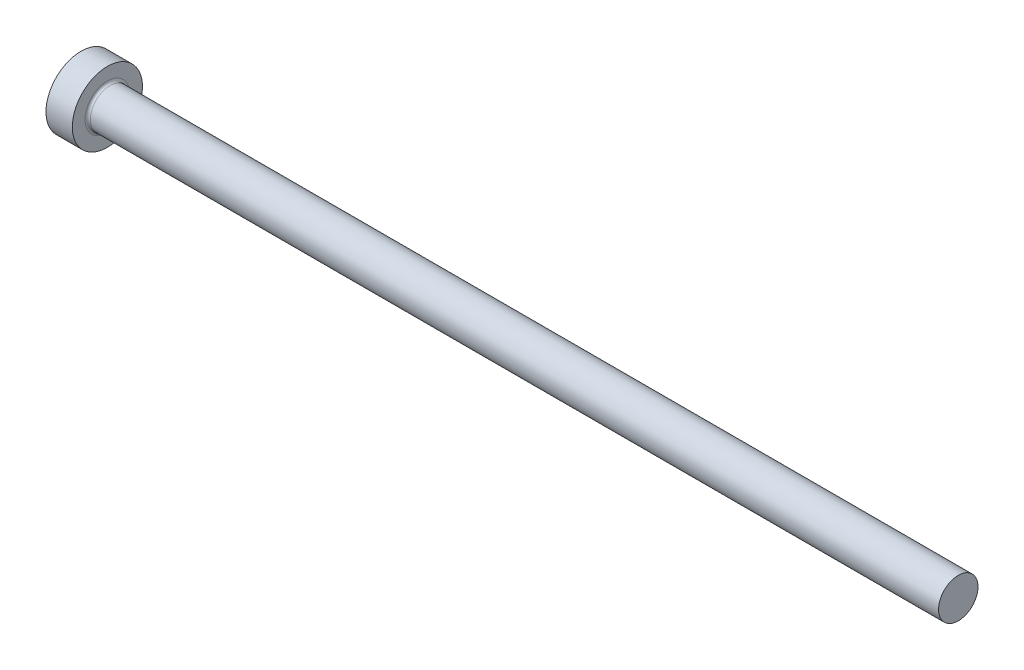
ISO-10303-21;
HEADER;
FILE_DESCRIPTION(('STEP AP214'),'2;1');
FILE_NAME('part.step','',(''),(''),'','','');
FILE_SCHEMA(('AUTOMOTIVE_DESIGN { 1 0 10303 214 1 1 1 1 }'));
ENDSEC;
DATA;
#1=APPLICATION_CONTEXT('core data for automotive mechanical design processes');
#2=APPLICATION_PROTOCOL_DEFINITION('international standard','automotive_design',2000,#1);
#3=PRODUCT_CONTEXT('',#1,'mechanical');
#4=PRODUCT('Part','Part','',(#3));
#5=PRODUCT_RELATED_PRODUCT_CATEGORY('part','',(#4));
#6=PRODUCT_DEFINITION_FORMATION('','',#4);
#7=PRODUCT_DEFINITION_CONTEXT('part definition',#1,'design');
#8=PRODUCT_DEFINITION('design','',#6,#7);
#9=PRODUCT_DEFINITION_SHAPE('','',#8);
#10=(LENGTH_UNIT() NAMED_UNIT(*) SI_UNIT(.MILLI.,.METRE.));
#11=(NAMED_UNIT(*) PLANE_ANGLE_UNIT() SI_UNIT($,.RADIAN.));
#12=(NAMED_UNIT(*) SI_UNIT($,.STERADIAN.) SOLID_ANGLE_UNIT());
#13=UNCERTAINTY_MEASURE_WITH_UNIT(LENGTH_MEASURE(1.E-05),#10,'distance_accuracy_value','');
#14=(GEOMETRIC_REPRESENTATION_CONTEXT(3) GLOBAL_UNCERTAINTY_ASSIGNED_CONTEXT((#13)) GLOBAL_UNIT_ASSIGNED_CONTEXT((#10,
#11,#12)) REPRESENTATION_CONTEXT('',''));
#15=CARTESIAN_POINT('',(0.,0.,0.));
#16=DIRECTION('',(0.,0.,1.));
#17=DIRECTION('',(1.,0.,0.));
#18=AXIS2_PLACEMENT_3D('',#15,#16,#17);
#19=CARTESIAN_POINT('',(0.,0.,0.));
#20=DIRECTION('',(-1.,0.,0.));
#21=DIRECTION('',(0.,-1.,0.));
#22=AXIS2_PLACEMENT_3D('',#19,#20,#21);
#23=PLANE('',#22);
#24=CARTESIAN_POINT('',(0.,0.,0.));
#25=DIRECTION('',(1.,0.,0.));
#26=DIRECTION('',(0.,1.,0.));
#27=AXIS2_PLACEMENT_3D('',#24,#25,#26);
#28=CIRCLE('',#27,4.);
#29=CARTESIAN_POINT('',(0.,4.,0.));
#30=VERTEX_POINT('',#29);
#31=EDGE_CURVE('E25',#30,#30,#28,.T.);
#32=ORIENTED_EDGE('',*,*,#31,.F.);
#33=EDGE_LOOP('',(#32));
#34=FACE_BOUND('',#33,.T.);
#35=ADVANCED_FACE('F14',(#34),#23,.T.);
#36=CARTESIAN_POINT('',(100.,0.,0.));
#37=DIRECTION('',(1.,0.,0.));
#38=DIRECTION('',(0.,1.,0.));
#39=AXIS2_PLACEMENT_3D('',#36,#37,#38);
#40=CYLINDRICAL_SURFACE('',#39,4.);
#41=ORIENTED_EDGE('',*,*,#31,.T.);
#42=EDGE_LOOP('',(#41));
#43=FACE_BOUND('',#42,.T.);
#44=CARTESIAN_POINT('',(3.,0.,0.));
#45=DIRECTION('',(1.,0.,0.));
#46=DIRECTION('',(0.,1.,0.));
#47=AXIS2_PLACEMENT_3D('',#44,#45,#46);
#48=CIRCLE('',#47,4.);
#49=CARTESIAN_POINT('',(3.,4.,0.));
#50=VERTEX_POINT('',#49);
#51=EDGE_CURVE('E29',#50,#50,#48,.T.);
#52=ORIENTED_EDGE('',*,*,#51,.F.);
#53=EDGE_LOOP('',(#52));
#54=FACE_BOUND('',#53,.T.);
#55=ADVANCED_FACE('F51',(#43,#54),#40,.T.);
#56=CARTESIAN_POINT('',(3.,4.,0.));
#57=DIRECTION('',(1.,0.,0.));
#58=DIRECTION('',(0.,1.,0.));
#59=AXIS2_PLACEMENT_3D('',#56,#57,#58);
#60=PLANE('',#59);
#61=CARTESIAN_POINT('',(3.,0.,0.));
#62=DIRECTION('',(1.,0.,0.));
#63=DIRECTION('',(0.,1.,0.));
#64=AXIS2_PLACEMENT_3D('',#61,#62,#63);
#65=CIRCLE('',#64,2.55);
#66=CARTESIAN_POINT('',(3.,2.55,0.));
#67=VERTEX_POINT('',#66);
#68=EDGE_CURVE('E9',#67,#67,#65,.F.);
#69=ORIENTED_EDGE('',*,*,#68,.T.);
#70=EDGE_LOOP('',(#69));
#71=FACE_BOUND('',#70,.T.);
#72=ORIENTED_EDGE('',*,*,#51,.T.);
#73=EDGE_LOOP('',(#72));
#74=FACE_BOUND('',#73,.T.);
#75=ADVANCED_FACE('F42',(#71,#74),#60,.T.);
#76=CARTESIAN_POINT('',(100.,0.,0.));
#77=DIRECTION('',(1.,0.,0.));
#78=DIRECTION('',(0.,1.,0.));
#79=AXIS2_PLACEMENT_3D('',#76,#77,#78);
#80=CYLINDRICAL_SURFACE('',#79,2.24999999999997);
#81=CARTESIAN_POINT('',(3.3,0.,0.));
#82=DIRECTION('',(1.,0.,0.));
#83=DIRECTION('',(0.,1.,0.));
#84=AXIS2_PLACEMENT_3D('',#81,#82,#83);
#85=CIRCLE('',#84,2.24999999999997);
#86=CARTESIAN_POINT('',(3.3,2.24999999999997,0.));
#87=VERTEX_POINT('',#86);
#88=EDGE_CURVE('E21',#87,#87,#85,.T.);
#89=ORIENTED_EDGE('',*,*,#88,.T.);
#90=EDGE_LOOP('',(#89));
#91=FACE_BOUND('',#90,.T.);
#92=CARTESIAN_POINT('',(100.,0.,0.));
#93=DIRECTION('',(1.,0.,0.));
#94=DIRECTION('',(0.,1.,0.));
#95=AXIS2_PLACEMENT_3D('',#92,#93,#94);
#96=CIRCLE('',#95,2.25);
#97=CARTESIAN_POINT('',(100.,2.24999999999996,0.));
#98=VERTEX_POINT('',#97);
#99=EDGE_CURVE('E34',#98,#98,#96,.T.);
#100=ORIENTED_EDGE('',*,*,#99,.F.);
#101=EDGE_LOOP('',(#100));
#102=FACE_BOUND('',#101,.T.);
#103=ADVANCED_FACE('F40',(#91,#102),#80,.T.);
#104=CARTESIAN_POINT('',(100.,2.24999999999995,0.));
#105=DIRECTION('',(1.,0.,0.));
#106=DIRECTION('',(0.,1.,0.));
#107=AXIS2_PLACEMENT_3D('',#104,#105,#106);
#108=PLANE('',#107);
#109=ORIENTED_EDGE('',*,*,#99,.T.);
#110=EDGE_LOOP('',(#109));
#111=FACE_BOUND('',#110,.T.);
#112=ADVANCED_FACE('F38',(#111),#108,.T.);
#113=CARTESIAN_POINT('',(3.3,0.,0.));
#114=DIRECTION('',(1.,0.,0.));
#115=DIRECTION('',(0.,1.,0.));
#116=AXIS2_PLACEMENT_3D('',#113,#114,#115);
#117=TOROIDAL_SURFACE('',#116,2.55,0.3);
#118=ORIENTED_EDGE('',*,*,#68,.F.);
#119=EDGE_LOOP('',(#118));
#120=FACE_BOUND('',#119,.T.);
#121=ORIENTED_EDGE('',*,*,#88,.F.);
#122=EDGE_LOOP('',(#121));
#123=FACE_BOUND('',#122,.T.);
#124=ADVANCED_FACE('F16',(#120,#123),#117,.F.);
#125=CLOSED_SHELL('',(#35,#55,#75,#103,#112,#124));
#126=MANIFOLD_SOLID_BREP('B1',#125);
#127=ADVANCED_BREP_SHAPE_REPRESENTATION('',(#18,#126),#14);
#128=SHAPE_DEFINITION_REPRESENTATION(#9,#127);
ENDSEC;
END-ISO-10303-21;
